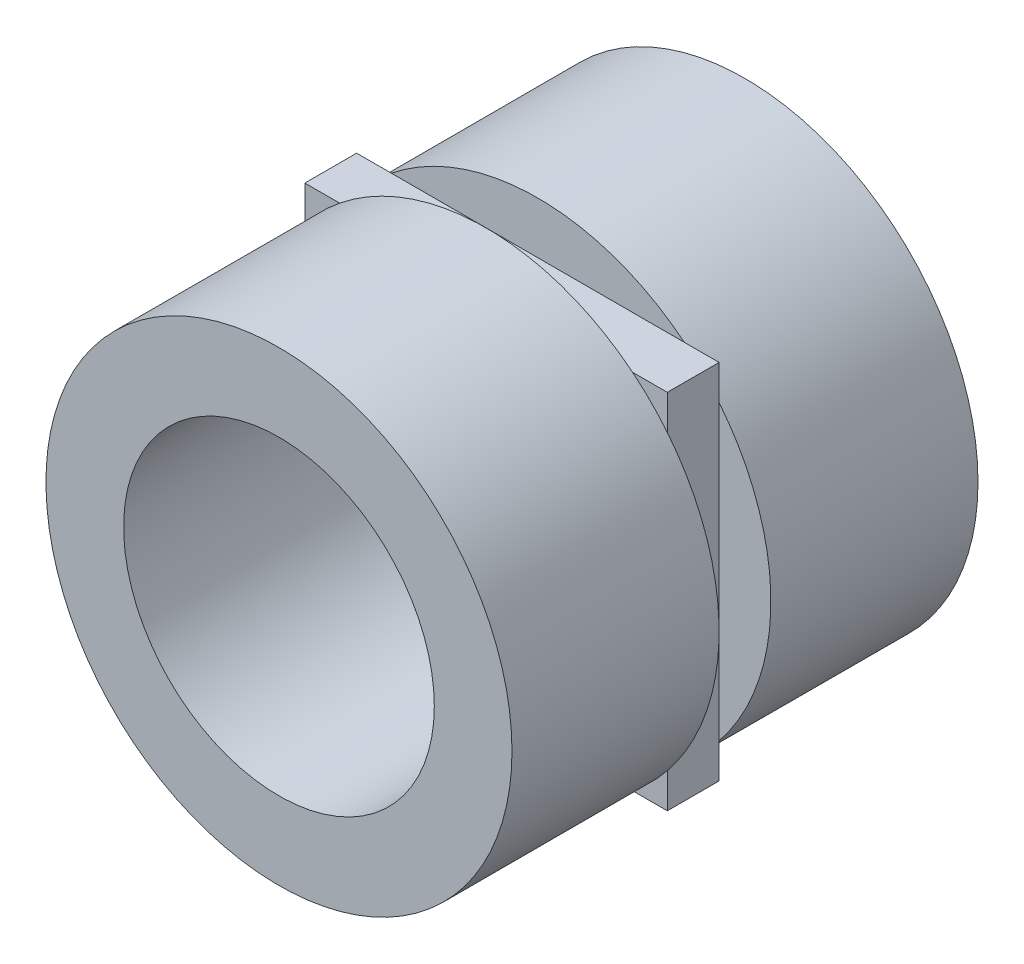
from build123d import *

# Parameters (mm, degrees)
ESQUISSE1_R             = 4.5
ESQUISSE1_R_2           = 3
EXTRUSION1_DEPTH        = 4.5
ESQUISSE2_OUTSIDE_W     = 14.118
ESQUISSE2_OUTSIDE_H     = 14.118
ESQUISSE2_OUTSIDE_W_2   = 7
ESQUISSE2_OUTSIDE_H_2   = 7
ENL_V_MAT_EXTRU_1_DEPTH = 0.5
EXTRUSION2_DEPTH        = 0.5


with BuildPart() as part:
    # Esquisse1 → Extrusion1 (new, symmetric)
    with BuildSketch(Plane.XY):
        Circle(ESQUISSE1_R)
        Circle(ESQUISSE1_R_2, mode=Mode.SUBTRACT)
    extrude(amount=EXTRUSION1_DEPTH, both=True)

    # Esquisse2 outside → Enl_v. mat.-Extru.1 (cut, symmetric)
    with BuildSketch(Plane.XY):
        Rectangle(ESQUISSE2_OUTSIDE_W, ESQUISSE2_OUTSIDE_H)
        Rectangle(ESQUISSE2_OUTSIDE_W_2, ESQUISSE2_OUTSIDE_H_2, mode=Mode.SUBTRACT)
    extrude(amount=ENL_V_MAT_EXTRU_1_DEPTH, both=True, mode=Mode.SUBTRACT)

    # Esquisse3 → Extrusion2 (add, symmetric)
    with BuildSketch(Plane.XY):
        with BuildLine():
            Line((-3.5, 3.5), (-2.828427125, 3.5))
            ThreePointArc((-2.828427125, 3.5), (-3.181980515, 3.181980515), (-3.5, 2.828427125))
            Line((-3.5, 2.828427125), (-3.5, 3.5))
        make_face()
        with BuildLine():
            Line((2.828427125, 3.5), (3.5, 3.5))
            Line((3.5, 3.5), (3.5, 2.828427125))
            ThreePointArc((3.5, 2.828427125), (3.181980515, 3.181980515), (2.828427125, 3.5))
        make_face()
        with BuildLine():
            Line((3.5, -3.5), (3.5, -2.828427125))
            ThreePointArc((3.5, -2.828427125), (3.181980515, -3.181980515), (2.828427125, -3.5))
            Line((2.828427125, -3.5), (3.5, -3.5))
        make_face()
        with BuildLine():
            Line((-2.828427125, -3.5), (-3.5, -3.5))
            Line((-3.5, -3.5), (-3.5, -2.828427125))
            ThreePointArc((-3.5, -2.828427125), (-3.181980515, -3.181980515), (-2.828427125, -3.5))
        make_face()
    extrude(amount=EXTRUSION2_DEPTH, both=True)


solid = part.part
